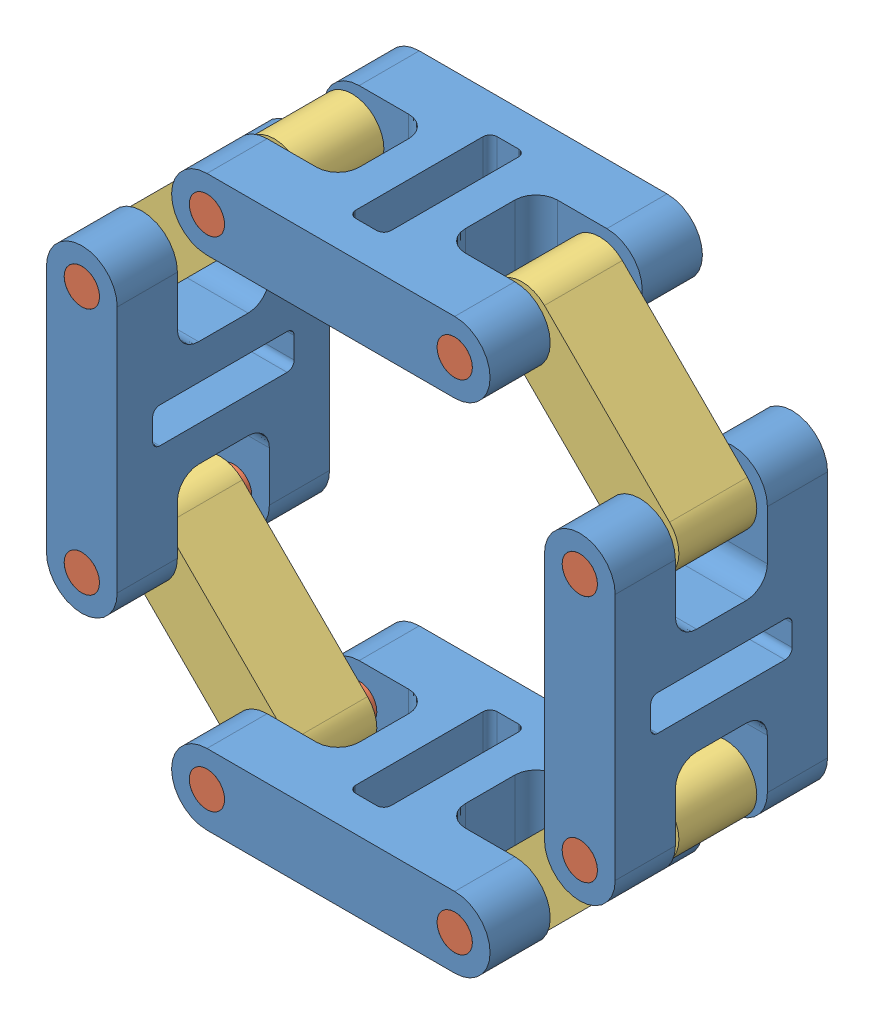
SolidWorks assembly Clase-3_EjercicioPractico-A.SLDASM, configuration Predeterminado (file format 13000). Lengths in mm.
Overall size (83.08 83.08 30).
16 component instances, 3 part files, 39 mates.
Components (placement in the parent):
- Clase-3_EjercicioPractico-A-Eslabon-1: Clase-3_EjercicioPractico-A-Eslabon.SLDPRT [Predeterminado] at (2.5 5 -15) x (1 0 0) z (0 -1 0) size (45 30 10)
- Clase-3_EjercicioPractico-A-Eje-1: Clase-3_EjercicioPractico-A-Eje.SLDPRT [Predeterminado] at (20 5 -15) x (0.922778 -0.385333 0) z (-0.385333 -0.922778 0) size (5 30 5)
- Clase-3_EjercicioPractico-A-Biela-1: Clase-3_EjercicioPractico-A-Biela.SLDPRT [Predeterminado] at (28.8388 13.8388 -20.5) x (0.707107 0.707107 0) z (0 0 1) size (34 9 11)
- Clase-3_EjercicioPractico-A-Eslabon-2: Clase-3_EjercicioPractico-A-Eslabon.SLDPRT [Predeterminado] at (37.6777 40.1777 -15) x (0 1 0) z (1 0 0) size (45 30 10)
- Clase-3_EjercicioPractico-A-Eje-2: Clase-3_EjercicioPractico-A-Eje.SLDPRT [Predeterminado] at (37.6777 22.6777 -15) x (0.922778 -0.385333 0) z (-0.385333 -0.922778 0) size (5 30 5)
- Clase-3_EjercicioPractico-A-Eje-4: Clase-3_EjercicioPractico-A-Eje.SLDPRT [Predeterminado] at (37.6777 57.6777 -15) x (0.922778 -0.385333 0) z (-0.385333 -0.922778 0) size (5 30 5)
- Clase-3_EjercicioPractico-A-Biela-3: Clase-3_EjercicioPractico-A-Biela.SLDPRT [Predeterminado] at (28.8388 66.5165 -20.5) x (-0.707107 0.707107 0) z (0 0 1) size (34 9 11)
- Clase-3_EjercicioPractico-A-Eslabon-4: Clase-3_EjercicioPractico-A-Eslabon.SLDPRT [Predeterminado] at (2.5 75.3553 -15) x (-1 0 0) z (0 1 0) size (45 30 10)
- Clase-3_EjercicioPractico-A-Eje-5: Clase-3_EjercicioPractico-A-Eje.SLDPRT [Predeterminado] at (20 75.3553 -15) x (0.922778 -0.385333 0) z (-0.385333 -0.922778 0) size (5 30 5)
- Clase-3_EjercicioPractico-A-Eje-6: Clase-3_EjercicioPractico-A-Eje.SLDPRT [Predeterminado] at (-15 75.3553 -15) x (0.922778 -0.385333 0) z (-0.385333 -0.922778 0) size (5 30 5)
- Clase-3_EjercicioPractico-A-Biela-4: Clase-3_EjercicioPractico-A-Biela.SLDPRT [Predeterminado] at (-23.8388 66.5165 -20.5) x (-0.707107 -0.707107 0) z (0 0 1) size (34 9 11)
- Clase-3_EjercicioPractico-A-Eslabon-5: Clase-3_EjercicioPractico-A-Eslabon.SLDPRT [Predeterminado] at (-32.6777 40.1777 -15) x (0 -1 0) z (-1 0 0) size (45 30 10)
- Clase-3_EjercicioPractico-A-Eje-7: Clase-3_EjercicioPractico-A-Eje.SLDPRT [Predeterminado] at (-32.6777 57.6777 -15) x (0.922778 -0.385333 0) z (-0.385333 -0.922778 0) size (5 30 5)
- Clase-3_EjercicioPractico-A-Biela-5: Clase-3_EjercicioPractico-A-Biela.SLDPRT [Predeterminado] at (-23.8388 13.8388 -19.5) x (-0.707107 0.707107 0) z (0 0 1) size (34 9 11)
- Clase-3_EjercicioPractico-A-Eje-8: Clase-3_EjercicioPractico-A-Eje.SLDPRT [Predeterminado] at (-32.6777 22.6777 -15) x (0.922778 -0.385333 0) z (-0.385333 -0.922778 0) size (5 30 5)
- Clase-3_EjercicioPractico-A-Eje-9: Clase-3_EjercicioPractico-A-Eje.SLDPRT [Predeterminado] at (-15 5 -15) x (0.922778 -0.385333 0) z (-0.385333 -0.922778 0) size (5 30 5)
Mates (geometry in assembly coordinates):
- Concéntrica1: concentric anti-aligned: cylinder of Clase-06_EjercicioPractico-A-1-1 through (20 5 -30) axis (0 0 1) radius 2.5; cylinder of Clase-06_EjercicioPractico-A-2-1 through (20 5 0) axis (0 0 -1) radius 2.5
- Coincidente1: coincident aligned: plane of Clase-06_EjercicioPractico-A-1-1 through (-15 5 0) normal (0 0 1); plane of Clase-06_EjercicioPractico-A-2-1 through (20 5 0) normal (0 0 1)
- Concéntrica2: concentric anti-aligned: cylinder of Clase-06_EjercicioPractico-A-2-1 through (20 5 0) axis (0 0 -1) radius 2.5; cylinder of Clase-06_EjercicioPractico-A-3-1 through (20 5 -20.5) axis (0 0 1) radius 2.5
- Distancia1: distance = 1 mm anti-aligned: plane of Clase-06_EjercicioPractico-A-1-1 through (25 0 -21.5) normal (0 0 1); plane of Clase-06_EjercicioPractico-A-3-1 through (20 5 -20.5) normal (0 0 -1)
- Concéntrica3: concentric anti-aligned: cylinder of Clase-06_EjercicioPractico-A-1-2 through (37.6777 22.6777 -30) axis (0 0 1) radius 2.5; cylinder of Clase-06_EjercicioPractico-A-2-2 through (37.6777 22.6777 0) axis (0 0 -1) radius 2.5
- Coincidente2: coincident aligned: plane of Clase-06_EjercicioPractico-A-1-2 through (37.6777 22.6777 0) normal (0 0 1); plane of Clase-06_EjercicioPractico-A-2-2 through (37.6777 22.6777 0) normal (0 0 1)
- Concéntrica4: concentric anti-aligned: cylinder of Clase-06_EjercicioPractico-A-3-1 through (37.6777 22.6777 -20.5) axis (0 0 1) radius 2.5; cylinder of Clase-06_EjercicioPractico-A-2-2 through (37.6777 22.6777 0) axis (0 0 -1) radius 2.5
- Coincidente3: coincident aligned: plane of Clase-06_EjercicioPractico-A-1-1 through (-15 5 0) normal (0 0 1); plane of Clase-06_EjercicioPractico-A-1-2 through (37.6777 22.6777 0) normal (0 0 1)
- Concéntrica5: concentric anti-aligned: cylinder of Clase-06_EjercicioPractico-A-1-3 through (146.9288 -40.4392 -49.3352) axis (0 1 0) radius 2.5; cylinder of Clase-06_EjercicioPractico-A-2-3 through (146.9288 -10.4392 -49.3352) axis (0 -1 0) radius 2.5
- Coincidente4: coincident aligned: plane of Clase-06_EjercicioPractico-A-1-3 through (146.9288 -10.4392 -49.3352) normal (0 1 0); plane of Clase-06_EjercicioPractico-A-2-3 through (146.9288 -10.4392 -49.3352) normal (0 1 0)
- Concéntrica7: concentric anti-aligned: cylinder of Clase-06_EjercicioPractico-A-1-4 through (20 75.3553 -30) axis (0 0 1) radius 2.5; cylinder of Clase-06_EjercicioPractico-A-2-5 through (20 75.3553 0) axis (0 0 -1) radius 2.5
- Coincidente5: coincident aligned: plane of Clase-06_EjercicioPractico-A-1-4 through (20 75.3553 0) normal (0 0 1); plane of Clase-06_EjercicioPractico-A-2-5 through (20 75.3553 0) normal (0 0 1)
- Concéntrica8: concentric anti-aligned: cylinder of Clase-06_EjercicioPractico-A-3-3 through (20 75.3553 -20.5) axis (0 0 1) radius 2.5; cylinder of Clase-06_EjercicioPractico-A-2-5 through (20 75.3553 0) axis (0 0 -1) radius 2.5
- Concéntrica9: concentric anti-aligned: cylinder of Clase-06_EjercicioPractico-A-2-4 through (37.6777 57.6777 0) axis (0 0 -1) radius 2.5; cylinder of Clase-06_EjercicioPractico-A-3-3 through (37.6777 57.6777 -20.5) axis (0 0 1) radius 2.5
- Concéntrica10: concentric anti-aligned: cylinder of Clase-06_EjercicioPractico-A-1-2 through (37.6777 57.6777 -30) axis (0 0 1) radius 2.5; cylinder of Clase-06_EjercicioPractico-A-2-4 through (37.6777 57.6777 0) axis (0 0 -1) radius 2.5
- Coincidente6: coincident aligned: plane of Clase-06_EjercicioPractico-A-1-2 through (37.6777 22.6777 0) normal (0 0 1); plane of Clase-06_EjercicioPractico-A-1-4 through (20 75.3553 0) normal (0 0 1)
- Distancia2: distance = 1 mm anti-aligned: plane of Clase-06_EjercicioPractico-A-3-3 through (37.6777 57.6777 -9.5) normal (0 0 1); plane of Clase-06_EjercicioPractico-A-1-2 through (42.6777 62.6777 -8.5) normal (0 0 -1)
- Concéntrica11: concentric anti-aligned: cylinder of Clase-06_EjercicioPractico-A-1-5 through (-32.6777 57.6777 -30) axis (0 0 1) radius 2.5; cylinder of Clase-06_EjercicioPractico-A-2-7 through (-32.6777 57.6777 0) axis (0 0 -1) radius 2.5
- Coincidente7: coincident aligned: plane of Clase-06_EjercicioPractico-A-1-5 through (-32.6777 57.6777 0) normal (0 0 1); plane of Clase-06_EjercicioPractico-A-2-7 through (-32.6777 57.6777 0) normal (0 0 1)
- Concéntrica12: concentric anti-aligned: cylinder of Clase-06_EjercicioPractico-A-3-4 through (-32.6777 57.6777 -20.5) axis (0 0 1) radius 2.5; cylinder of Clase-06_EjercicioPractico-A-2-7 through (-32.6777 57.6777 0) axis (0 0 -1) radius 2.5
- Concéntrica13: concentric anti-aligned: cylinder of Clase-06_EjercicioPractico-A-2-6 through (-15 75.3553 0) axis (0 0 -1) radius 2.5; cylinder of Clase-06_EjercicioPractico-A-3-4 through (-15 75.3553 -20.5) axis (0 0 1) radius 2.5
- Concéntrica14: concentric anti-aligned: cylinder of Clase-06_EjercicioPractico-A-1-4 through (-15 75.3553 -30) axis (0 0 1) radius 2.5; cylinder of Clase-06_EjercicioPractico-A-2-6 through (-15 75.3553 0) axis (0 0 -1) radius 2.5
- Distancia3: distance = 1 mm anti-aligned: plane of Clase-06_EjercicioPractico-A-3-4 through (-15 75.3553 -9.5) normal (0 0 1); plane of Clase-06_EjercicioPractico-A-1-4 through (-20 80.3553 -8.5) normal (0 0 -1)
- Coincidente8: coincident aligned: plane of Clase-06_EjercicioPractico-A-1-4 through (20 75.3553 0) normal (0 0 1); plane of Clase-06_EjercicioPractico-A-1-5 through (-32.6777 57.6777 0) normal (0 0 1)
- Coincidente9: coincident aligned: plane of Clase-06_EjercicioPractico-A-1-4 through (20 75.3553 0) normal (0 0 1); plane of Clase-06_EjercicioPractico-A-2-6 through (-15 75.3553 0) normal (0 0 1)
- Coincidente10: coincident aligned: plane of Clase-06_EjercicioPractico-A-1-2 through (37.6777 22.6777 0) normal (0 0 1); plane of Clase-06_EjercicioPractico-A-2-4 through (37.6777 57.6777 0) normal (0 0 1)
- Paralelo1: parallel aligned: plane of Clase-06_EjercicioPractico-A-1-1 through (-15 0 0) normal (0 -1 0); plane of Clase-06_EjercicioPractico-A-1-4 through (20 70.3553 0) normal (0 -1 0)
- Concéntrica15: concentric anti-aligned: cylinder of Clase-06_EjercicioPractico-A-3-5 through (-32.6777 22.6777 -19.5) axis (0 0 1) radius 2.5; cylinder of Clase-06_EjercicioPractico-A-2-8 through (-32.6777 22.6777 0) axis (0 0 -1) radius 2.5
- Concéntrica16: concentric anti-aligned: cylinder of Clase-06_EjercicioPractico-A-1-5 through (-32.6777 22.6777 -30) axis (0 0 1) radius 2.5; cylinder of Clase-06_EjercicioPractico-A-2-8 through (-32.6777 22.6777 0) axis (0 0 -1) radius 2.5
- Coincidente11: coincident aligned: plane of Clase-06_EjercicioPractico-A-1-5 through (-32.6777 57.6777 0) normal (0 0 1); plane of Clase-06_EjercicioPractico-A-2-8 through (-32.6777 22.6777 0) normal (0 0 1)
- Concéntrica17: concentric anti-aligned: cylinder of Clase-06_EjercicioPractico-A-3-5 through (-32.6777 22.6777 -19.5) axis (0 0 1) radius 2.5; cylinder of Clase-06_EjercicioPractico-A-2-8 through (-32.6777 22.6777 0) axis (0 0 -1) radius 2.5
- Coincidente12: coincident anti-aligned: plane of Clase-06_EjercicioPractico-A-1-5 through (-37.6777 17.6777 -8.5) normal (0 0 -1); plane of Clase-06_EjercicioPractico-A-3-5 through (-15 5 -8.5) normal (0 0 1)
- Concéntrica18: concentric anti-aligned: cylinder of Clase-06_EjercicioPractico-A-3-5 through (-15 5 -19.5) axis (0 0 1) radius 2.5; cylinder of Clase-06_EjercicioPractico-A-2-9 through (-15 5 0) axis (0 0 -1) radius 2.5
- Concéntrica19: concentric anti-aligned: cylinder of Clase-06_EjercicioPractico-A-1-1 through (-15 5 -30) axis (0 0 1) radius 2.5; cylinder of Clase-06_EjercicioPractico-A-2-9 through (-15 5 0) axis (0 0 -1) radius 2.5
- Coincidente13: coincident aligned: plane of Clase-06_EjercicioPractico-A-1-1 through (-15 5 0) normal (0 0 1); plane of Clase-06_EjercicioPractico-A-2-9 through (-15 5 0) normal (0 0 1)
- Paralelo2: parallel anti-aligned: plane of Clase-06_EjercicioPractico-A-1-2 through (32.6777 22.6777 0) normal (-1 0 0); plane of Clase-06_EjercicioPractico-A-1-5 through (-27.6777 57.6777 0) normal (1 0 0)
- Coincidente14: coincident aligned: plane of Clase-06_EjercicioPractico-A-1-1 through (0 10 -25) normal (1 0 0); plane of Clase-06_EjercicioPractico-A-1-4 through (0 70.3553 -25) normal (1 0 0)
- Coincidente15: coincident aligned: plane of Clase-06_EjercicioPractico-A-1-2 through (32.6777 42.6777 -25) normal (0 -1 0); plane of Clase-06_EjercicioPractico-A-1-5 through (-27.6777 42.6777 -25) normal (0 -1 0)
- Ángulo2: planar angle = 0.785398 rad aligned: plane of Clase-06_EjercicioPractico-A-1-1 through (-15 0 0) normal (0 -1 0); plane of Clase-06_EjercicioPractico-A-3-1 through (23.182 1.818 -9.5) normal (0.707107 -0.707107 0)
